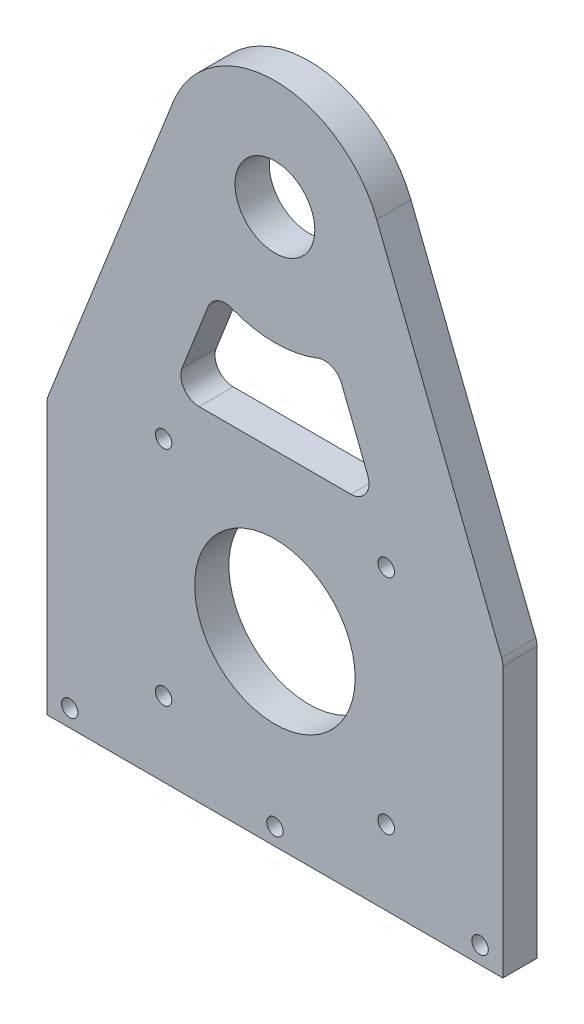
from build123d import *

# Parameters (mm, degrees)
BOSS_EXTRUDE1_DEPTH = 4.7625
SKETCH2_R           = 1.143
CUT_EXTRUDE1_DEPTH  = 98.778056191
SKETCH3_R           = 11.176
SKETCH3_R_2         = 1.143
CUT_EXTRUDE2_DEPTH  = 98.778056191
SKETCH5_R           = 5.55625
CUT_EXTRUDE3_DEPTH  = 98.778056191
CUT_EXTRUDE4_DEPTH  = 98.778056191
FILLET1_R           = 2.54


with BuildPart() as part:
    # Sketch1 → Boss-Extrude1 (new body)
    with BuildSketch(Plane.XY):
        with BuildLine():
            Line((-31.75, 0), (31.75, 0))
            Line((31.75, 0), (31.75, 38.1))
            Line((31.75, 38.1), (14.179447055, 82.702714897))
            ThreePointArc((14.179447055, 82.702714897), (0, 92.35694), (-14.179447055, 82.702714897))
            Line((-14.179447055, 82.702714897), (-31.75, 38.1))
            Line((-31.75, 38.1), (-31.75, 0))
        make_face()
    extrude(amount=BOSS_EXTRUDE1_DEPTH)

    # Sketch2 → Cut-Extrude1 (cut, through all)
    with BuildSketch(Plane.XY.offset(4.7625)):
        with Locations((-28.575, 2.38125)):
            Circle(SKETCH2_R)
        with Locations((28.575, 2.38125)):
            Circle(SKETCH2_R)
        with Locations((0, 2.38125)):
            Circle(SKETCH2_R)
    extrude(amount=-CUT_EXTRUDE1_DEPTH, mode=Mode.SUBTRACT)

    # Sketch3 → Cut-Extrude2 (cut, through all)
    with BuildSketch(Plane.XY.offset(4.7625)):
        with Locations((0, 25.91308)):
            Circle(SKETCH3_R)
        with Locations((-15.5, 41.41308)):
            Circle(SKETCH3_R_2)
        with Locations((15.5, 41.41308)):
            Circle(SKETCH3_R_2)
        with Locations((15.5, 10.41308)):
            Circle(SKETCH3_R_2)
        with Locations((-15.5, 10.41308)):
            Circle(SKETCH3_R_2)
    extrude(amount=-CUT_EXTRUDE2_DEPTH, mode=Mode.SUBTRACT)

    # Sketch5 → Cut-Extrude3 (cut, through all)
    with BuildSketch(Plane.XY.offset(4.7625)):
        with Locations((0, 77.11694)):
            Circle(SKETCH5_R)
    extrude(amount=-CUT_EXTRUDE3_DEPTH, mode=Mode.SUBTRACT)

    # Sketch6 → Cut-Extrude4 (cut, through all)
    with BuildSketch(Plane.XY.offset(4.7625)):
        with BuildLine():
            Line((-8.291063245, 63.000171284), (-14.293480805, 47.76308))
            Line((-14.293480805, 47.76308), (14.293480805, 47.76308))
            Line((14.293480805, 47.76308), (8.291063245, 63.000171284))
            ThreePointArc((8.291063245, 63.000171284), (0, 60.745474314), (-8.291063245, 63.000171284))
        make_face()
    extrude(amount=-CUT_EXTRUDE4_DEPTH, mode=Mode.SUBTRACT)

    # Fillet1
    fillet1_edges = [part.edges().sort_by_distance(p)[0] for p in [
        (-31.75, 38.1, 2.38125),
        (31.75, 38.1, 2.38125),
        (-8.291063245, 63.000171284, 2.38125),
        (8.291063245, 63.000171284, 2.38125),
        (14.293480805, 47.76308, 2.38125),
        (-14.293480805, 47.76308, 2.38125),
    ]]
    fillet(fillet1_edges, radius=FILLET1_R)


solid = part.part
